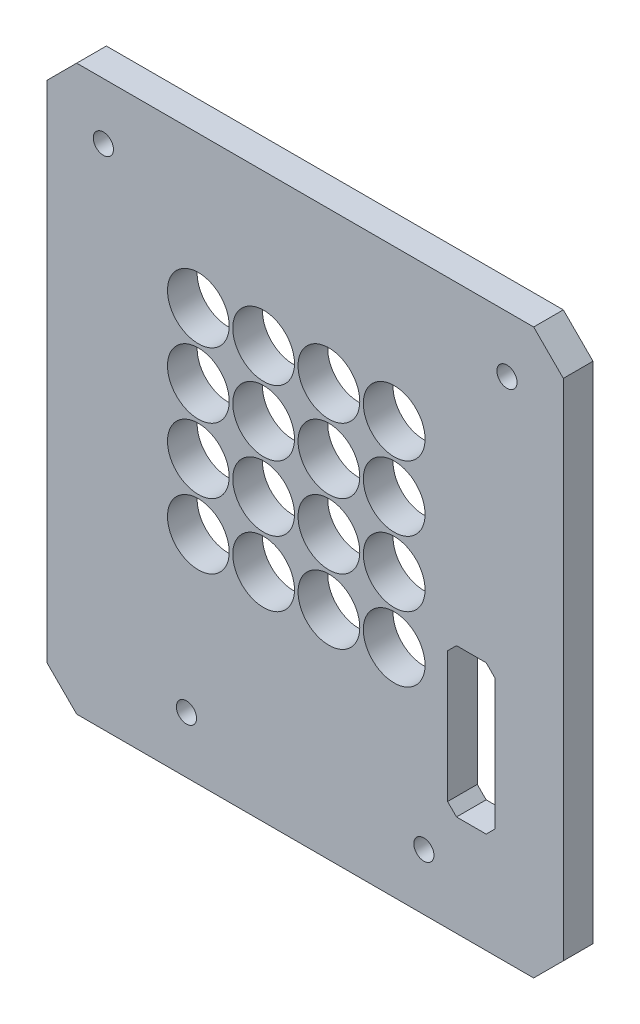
from build123d import *

# Parameters (mm, degrees)
SKETCH_1_R                                     = 5.2
SKETCH_1_R_2                                   = 1.7
GUIDE_16_THROUGH_BORES_AND_R2_R16_WINDOW_DEPTH = 5


with BuildPart() as part:
    # Sketch 1 → Guide_16_THROUGH_bores_and_R2_R16_window (new body)
    with BuildSketch(Plane.XY):
        Polygon((-37, -53), (40, -53), (45, -48), (45, 37), (40, 42), (-37, 42), (-42, 37), (-42, -48), align=None)
        with Locations((-16.5, -16.5)):
            Circle(SKETCH_1_R, mode=Mode.SUBTRACT)
        with Locations((-5.5, -16.5)):
            Circle(SKETCH_1_R, mode=Mode.SUBTRACT)
        with Locations((5.5, -16.5)):
            Circle(SKETCH_1_R, mode=Mode.SUBTRACT)
        with Locations((16.5, -16.5)):
            Circle(SKETCH_1_R, mode=Mode.SUBTRACT)
        with Locations((-16.5, -5.5)):
            Circle(SKETCH_1_R, mode=Mode.SUBTRACT)
        with Locations((-5.5, -5.5)):
            Circle(SKETCH_1_R, mode=Mode.SUBTRACT)
        with Locations((5.5, -5.5)):
            Circle(SKETCH_1_R, mode=Mode.SUBTRACT)
        with Locations((16.5, -5.5)):
            Circle(SKETCH_1_R, mode=Mode.SUBTRACT)
        with Locations((-16.5, 5.5)):
            Circle(SKETCH_1_R, mode=Mode.SUBTRACT)
        with Locations((-5.5, 5.5)):
            Circle(SKETCH_1_R, mode=Mode.SUBTRACT)
        with Locations((5.5, 5.5)):
            Circle(SKETCH_1_R, mode=Mode.SUBTRACT)
        with Locations((16.5, 5.5)):
            Circle(SKETCH_1_R, mode=Mode.SUBTRACT)
        with Locations((-16.5, 16.5)):
            Circle(SKETCH_1_R, mode=Mode.SUBTRACT)
        with Locations((-5.5, 16.5)):
            Circle(SKETCH_1_R, mode=Mode.SUBTRACT)
        with Locations((5.5, 16.5)):
            Circle(SKETCH_1_R, mode=Mode.SUBTRACT)
        with Locations((16.5, 16.5)):
            Circle(SKETCH_1_R, mode=Mode.SUBTRACT)
        with Locations((-32.5, 32.5)):
            Circle(SKETCH_1_R_2, mode=Mode.SUBTRACT)
        with Locations((35.5, 32.5)):
            Circle(SKETCH_1_R_2, mode=Mode.SUBTRACT)
        with Locations((-18.5, -43.5)):
            Circle(SKETCH_1_R_2, mode=Mode.SUBTRACT)
        with Locations((21.5, -43.5)):
            Circle(SKETCH_1_R_2, mode=Mode.SUBTRACT)
        Polygon((27, -36), (32, -36), (33.5, -34.5), (33.5, -12.5), (32, -11), (27, -11), (25.5, -12.5), (25.5, -34.5), align=None, mode=Mode.SUBTRACT)
    extrude(amount=GUIDE_16_THROUGH_BORES_AND_R2_R16_WINDOW_DEPTH)


solid = part.part
